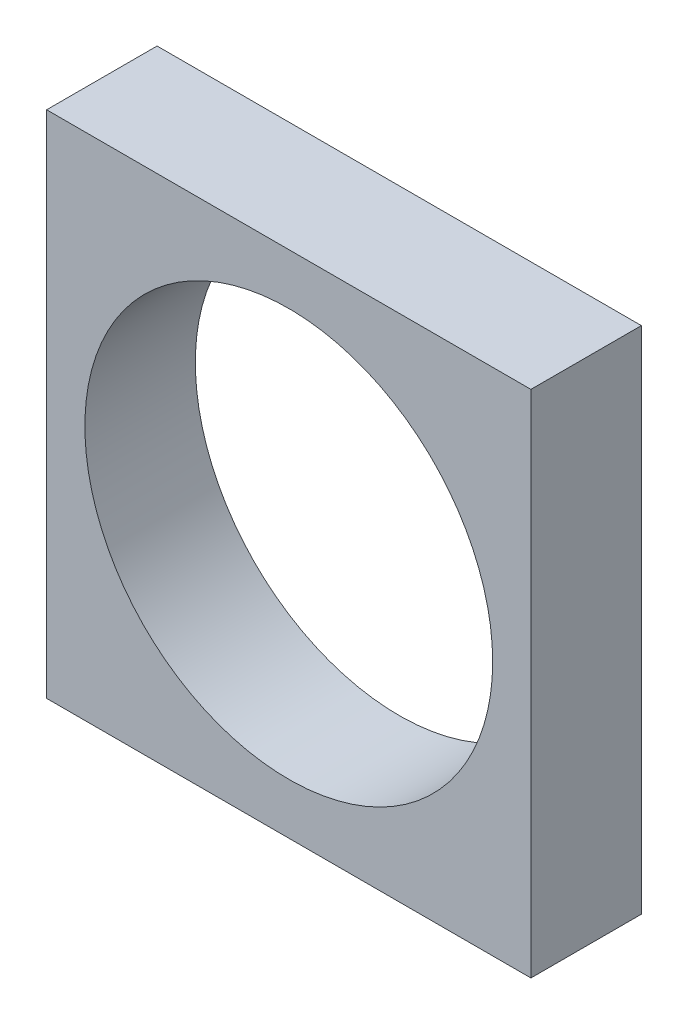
ISO-10303-21;
HEADER;
FILE_DESCRIPTION(('STEP AP214'),'2;1');
FILE_NAME('part.step','',(''),(''),'','','');
FILE_SCHEMA(('AUTOMOTIVE_DESIGN { 1 0 10303 214 1 1 1 1 }'));
ENDSEC;
DATA;
#1=APPLICATION_CONTEXT('core data for automotive mechanical design processes');
#2=APPLICATION_PROTOCOL_DEFINITION('international standard','automotive_design',2000,#1);
#3=PRODUCT_CONTEXT('',#1,'mechanical');
#4=PRODUCT('Part','Part','',(#3));
#5=PRODUCT_RELATED_PRODUCT_CATEGORY('part','',(#4));
#6=PRODUCT_DEFINITION_FORMATION('','',#4);
#7=PRODUCT_DEFINITION_CONTEXT('part definition',#1,'design');
#8=PRODUCT_DEFINITION('design','',#6,#7);
#9=PRODUCT_DEFINITION_SHAPE('','',#8);
#10=(LENGTH_UNIT() NAMED_UNIT(*) SI_UNIT(.MILLI.,.METRE.));
#11=(NAMED_UNIT(*) PLANE_ANGLE_UNIT() SI_UNIT($,.RADIAN.));
#12=(NAMED_UNIT(*) SI_UNIT($,.STERADIAN.) SOLID_ANGLE_UNIT());
#13=UNCERTAINTY_MEASURE_WITH_UNIT(LENGTH_MEASURE(1.E-05),#10,'distance_accuracy_value','');
#14=(GEOMETRIC_REPRESENTATION_CONTEXT(3) GLOBAL_UNCERTAINTY_ASSIGNED_CONTEXT((#13)) GLOBAL_UNIT_ASSIGNED_CONTEXT((#10,
#11,#12)) REPRESENTATION_CONTEXT('',''));
#15=CARTESIAN_POINT('',(0.,0.,0.));
#16=DIRECTION('',(0.,0.,1.));
#17=DIRECTION('',(1.,0.,0.));
#18=AXIS2_PLACEMENT_3D('',#15,#16,#17);
#19=CARTESIAN_POINT('',(0.,0.,13.));
#20=DIRECTION('',(1.,0.,0.));
#21=DIRECTION('',(0.,0.,-1.));
#22=AXIS2_PLACEMENT_3D('',#19,#20,#21);
#23=PLANE('',#22);
#24=DIRECTION('',(0.,-1.,0.));
#25=VECTOR('',#24,1.);
#26=CARTESIAN_POINT('',(0.,0.,0.));
#27=LINE('',#26,#25);
#28=CARTESIAN_POINT('',(0.,60.,0.));
#29=VERTEX_POINT('',#28);
#30=CARTESIAN_POINT('',(0.,0.,0.));
#31=VERTEX_POINT('',#30);
#32=EDGE_CURVE('E97',#29,#31,#27,.T.);
#33=ORIENTED_EDGE('',*,*,#32,.T.);
#34=DIRECTION('',(0.,0.,-1.));
#35=VECTOR('',#34,1.);
#36=CARTESIAN_POINT('',(0.,0.,13.));
#37=LINE('',#36,#35);
#38=CARTESIAN_POINT('',(0.,0.,13.));
#39=VERTEX_POINT('',#38);
#40=EDGE_CURVE('E11',#39,#31,#37,.T.);
#41=ORIENTED_EDGE('',*,*,#40,.F.);
#42=DIRECTION('',(0.,-1.,0.));
#43=VECTOR('',#42,1.);
#44=CARTESIAN_POINT('',(0.,0.,13.));
#45=LINE('',#44,#43);
#46=CARTESIAN_POINT('',(0.,60.,13.));
#47=VERTEX_POINT('',#46);
#48=EDGE_CURVE('E85',#47,#39,#45,.T.);
#49=ORIENTED_EDGE('',*,*,#48,.F.);
#50=DIRECTION('',(0.,0.,-1.));
#51=VECTOR('',#50,1.);
#52=CARTESIAN_POINT('',(0.,60.,13.));
#53=LINE('',#52,#51);
#54=EDGE_CURVE('E93',#47,#29,#53,.T.);
#55=ORIENTED_EDGE('',*,*,#54,.T.);
#56=EDGE_LOOP('',(#33,#41,#49,#55));
#57=FACE_BOUND('',#56,.T.);
#58=ADVANCED_FACE('F34',(#57),#23,.F.);
#59=CARTESIAN_POINT('',(0.,0.,13.));
#60=DIRECTION('',(0.,1.,0.));
#61=DIRECTION('',(0.,0.,1.));
#62=AXIS2_PLACEMENT_3D('',#59,#60,#61);
#63=PLANE('',#62);
#64=DIRECTION('',(1.,0.,0.));
#65=VECTOR('',#64,1.);
#66=CARTESIAN_POINT('',(0.,0.,0.));
#67=LINE('',#66,#65);
#68=CARTESIAN_POINT('',(57.,0.,0.));
#69=VERTEX_POINT('',#68);
#70=EDGE_CURVE('E89',#31,#69,#67,.T.);
#71=ORIENTED_EDGE('',*,*,#70,.T.);
#72=DIRECTION('',(0.,0.,-1.));
#73=VECTOR('',#72,1.);
#74=CARTESIAN_POINT('',(57.,0.,13.));
#75=LINE('',#74,#73);
#76=CARTESIAN_POINT('',(57.,0.,13.));
#77=VERTEX_POINT('',#76);
#78=EDGE_CURVE('E42',#77,#69,#75,.T.);
#79=ORIENTED_EDGE('',*,*,#78,.F.);
#80=DIRECTION('',(1.,0.,0.));
#81=VECTOR('',#80,1.);
#82=CARTESIAN_POINT('',(0.,0.,13.));
#83=LINE('',#82,#81);
#84=EDGE_CURVE('E80',#39,#77,#83,.T.);
#85=ORIENTED_EDGE('',*,*,#84,.F.);
#86=ORIENTED_EDGE('',*,*,#40,.T.);
#87=EDGE_LOOP('',(#71,#79,#85,#86));
#88=FACE_BOUND('',#87,.T.);
#89=ADVANCED_FACE('F88',(#88),#63,.F.);
#90=CARTESIAN_POINT('',(57.,0.,13.));
#91=DIRECTION('',(-1.,0.,0.));
#92=DIRECTION('',(0.,0.,1.));
#93=AXIS2_PLACEMENT_3D('',#90,#91,#92);
#94=PLANE('',#93);
#95=DIRECTION('',(0.,1.,0.));
#96=VECTOR('',#95,1.);
#97=CARTESIAN_POINT('',(57.,0.,0.));
#98=LINE('',#97,#96);
#99=CARTESIAN_POINT('',(57.,60.,0.));
#100=VERTEX_POINT('',#99);
#101=EDGE_CURVE('E67',#69,#100,#98,.T.);
#102=ORIENTED_EDGE('',*,*,#101,.T.);
#103=DIRECTION('',(0.,0.,-1.));
#104=VECTOR('',#103,1.);
#105=CARTESIAN_POINT('',(57.,60.,13.));
#106=LINE('',#105,#104);
#107=CARTESIAN_POINT('',(57.,60.,13.));
#108=VERTEX_POINT('',#107);
#109=EDGE_CURVE('E90',#108,#100,#106,.T.);
#110=ORIENTED_EDGE('',*,*,#109,.F.);
#111=DIRECTION('',(0.,1.,0.));
#112=VECTOR('',#111,1.);
#113=CARTESIAN_POINT('',(57.,0.,13.));
#114=LINE('',#113,#112);
#115=EDGE_CURVE('E83',#77,#108,#114,.T.);
#116=ORIENTED_EDGE('',*,*,#115,.F.);
#117=ORIENTED_EDGE('',*,*,#78,.T.);
#118=EDGE_LOOP('',(#102,#110,#116,#117));
#119=FACE_BOUND('',#118,.T.);
#120=ADVANCED_FACE('F91',(#119),#94,.F.);
#121=CARTESIAN_POINT('',(0.,60.,13.));
#122=DIRECTION('',(0.,-1.,0.));
#123=DIRECTION('',(0.,0.,-1.));
#124=AXIS2_PLACEMENT_3D('',#121,#122,#123);
#125=PLANE('',#124);
#126=DIRECTION('',(-1.,0.,0.));
#127=VECTOR('',#126,1.);
#128=CARTESIAN_POINT('',(0.,60.,0.));
#129=LINE('',#128,#127);
#130=EDGE_CURVE('E73',#100,#29,#129,.T.);
#131=ORIENTED_EDGE('',*,*,#130,.T.);
#132=ORIENTED_EDGE('',*,*,#54,.F.);
#133=DIRECTION('',(-1.,0.,0.));
#134=VECTOR('',#133,1.);
#135=CARTESIAN_POINT('',(0.,60.,13.));
#136=LINE('',#135,#134);
#137=EDGE_CURVE('E50',#108,#47,#136,.T.);
#138=ORIENTED_EDGE('',*,*,#137,.F.);
#139=ORIENTED_EDGE('',*,*,#109,.T.);
#140=EDGE_LOOP('',(#131,#132,#138,#139));
#141=FACE_BOUND('',#140,.T.);
#142=ADVANCED_FACE('F105',(#141),#125,.F.);
#143=CARTESIAN_POINT('',(0.,60.,13.));
#144=DIRECTION('',(0.,0.,-1.));
#145=DIRECTION('',(-1.,0.,0.));
#146=AXIS2_PLACEMENT_3D('',#143,#144,#145);
#147=PLANE('',#146);
#148=CARTESIAN_POINT('',(28.5,30.,13.));
#149=DIRECTION('',(0.,0.,1.));
#150=DIRECTION('',(1.,0.,0.));
#151=AXIS2_PLACEMENT_3D('',#148,#149,#150);
#152=CIRCLE('',#151,24.);
#153=CARTESIAN_POINT('',(52.5,30.,13.));
#154=VERTEX_POINT('',#153);
#155=EDGE_CURVE('E111',#154,#154,#152,.T.);
#156=ORIENTED_EDGE('',*,*,#155,.F.);
#157=EDGE_LOOP('',(#156));
#158=FACE_BOUND('',#157,.T.);
#159=ORIENTED_EDGE('',*,*,#48,.T.);
#160=ORIENTED_EDGE('',*,*,#84,.T.);
#161=ORIENTED_EDGE('',*,*,#115,.T.);
#162=ORIENTED_EDGE('',*,*,#137,.T.);
#163=EDGE_LOOP('',(#159,#160,#161,#162));
#164=FACE_BOUND('',#163,.T.);
#165=ADVANCED_FACE('F81',(#158,#164),#147,.F.);
#166=CARTESIAN_POINT('',(0.,60.,0.));
#167=DIRECTION('',(0.,0.,-1.));
#168=DIRECTION('',(-1.,0.,0.));
#169=AXIS2_PLACEMENT_3D('',#166,#167,#168);
#170=PLANE('',#169);
#171=CARTESIAN_POINT('',(28.5,30.,0.));
#172=DIRECTION('',(0.,0.,1.));
#173=DIRECTION('',(1.,0.,0.));
#174=AXIS2_PLACEMENT_3D('',#171,#172,#173);
#175=CIRCLE('',#174,24.);
#176=CARTESIAN_POINT('',(52.5,30.,0.));
#177=VERTEX_POINT('',#176);
#178=EDGE_CURVE('E100',#177,#177,#175,.T.);
#179=ORIENTED_EDGE('',*,*,#178,.T.);
#180=EDGE_LOOP('',(#179));
#181=FACE_BOUND('',#180,.T.);
#182=ORIENTED_EDGE('',*,*,#32,.F.);
#183=ORIENTED_EDGE('',*,*,#130,.F.);
#184=ORIENTED_EDGE('',*,*,#101,.F.);
#185=ORIENTED_EDGE('',*,*,#70,.F.);
#186=EDGE_LOOP('',(#182,#183,#184,#185));
#187=FACE_BOUND('',#186,.T.);
#188=ADVANCED_FACE('F108',(#181,#187),#170,.T.);
#189=CARTESIAN_POINT('',(28.5,30.,0.));
#190=DIRECTION('',(0.,0.,1.));
#191=DIRECTION('',(1.,0.,0.));
#192=AXIS2_PLACEMENT_3D('',#189,#190,#191);
#193=CYLINDRICAL_SURFACE('',#192,24.);
#194=CARTESIAN_POINT('',(52.5,30.,0.));
#195=CARTESIAN_POINT('',(52.5,30.,0.135416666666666));
#196=CARTESIAN_POINT('',(52.5,30.,0.270833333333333));
#197=CARTESIAN_POINT('',(52.5,30.,0.541666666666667));
#198=CARTESIAN_POINT('',(52.5,30.,0.677083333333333));
#199=CARTESIAN_POINT('',(52.5,30.,0.947916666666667));
#200=CARTESIAN_POINT('',(52.5,30.,1.08333333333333));
#201=CARTESIAN_POINT('',(52.5,30.,1.35416666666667));
#202=CARTESIAN_POINT('',(52.5,30.,1.48958333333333));
#203=CARTESIAN_POINT('',(52.5,30.,1.76041666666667));
#204=CARTESIAN_POINT('',(52.5,30.,1.89583333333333));
#205=CARTESIAN_POINT('',(52.5,30.,2.16666666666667));
#206=CARTESIAN_POINT('',(52.5,30.,2.30208333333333));
#207=CARTESIAN_POINT('',(52.5,30.,2.57291666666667));
#208=CARTESIAN_POINT('',(52.5,30.,2.70833333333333));
#209=CARTESIAN_POINT('',(52.5,30.,2.97916666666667));
#210=CARTESIAN_POINT('',(52.5,30.,3.11458333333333));
#211=CARTESIAN_POINT('',(52.5,30.,3.38541666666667));
#212=CARTESIAN_POINT('',(52.5,30.,3.52083333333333));
#213=CARTESIAN_POINT('',(52.5,30.,3.79166666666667));
#214=CARTESIAN_POINT('',(52.5,30.,3.92708333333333));
#215=CARTESIAN_POINT('',(52.5,30.,4.19791666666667));
#216=CARTESIAN_POINT('',(52.5,30.,4.33333333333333));
#217=CARTESIAN_POINT('',(52.5,30.,4.60416666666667));
#218=CARTESIAN_POINT('',(52.5,30.,4.73958333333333));
#219=CARTESIAN_POINT('',(52.5,30.,5.01041666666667));
#220=CARTESIAN_POINT('',(52.5,30.,5.14583333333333));
#221=CARTESIAN_POINT('',(52.5,30.,5.41666666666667));
#222=CARTESIAN_POINT('',(52.5,30.,5.55208333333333));
#223=CARTESIAN_POINT('',(52.5,30.,5.82291666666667));
#224=CARTESIAN_POINT('',(52.5,30.,5.95833333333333));
#225=CARTESIAN_POINT('',(52.5,30.,6.22916666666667));
#226=CARTESIAN_POINT('',(52.5,30.,6.36458333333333));
#227=CARTESIAN_POINT('',(52.5,30.,6.63541666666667));
#228=CARTESIAN_POINT('',(52.5,30.,6.77083333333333));
#229=CARTESIAN_POINT('',(52.5,30.,7.04166666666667));
#230=CARTESIAN_POINT('',(52.5,30.,7.17708333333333));
#231=CARTESIAN_POINT('',(52.5,30.,7.44791666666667));
#232=CARTESIAN_POINT('',(52.5,30.,7.58333333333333));
#233=CARTESIAN_POINT('',(52.5,30.,7.85416666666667));
#234=CARTESIAN_POINT('',(52.5,30.,7.98958333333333));
#235=CARTESIAN_POINT('',(52.5,30.,8.26041666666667));
#236=CARTESIAN_POINT('',(52.5,30.,8.39583333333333));
#237=CARTESIAN_POINT('',(52.5,30.,8.66666666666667));
#238=CARTESIAN_POINT('',(52.5,30.,8.80208333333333));
#239=CARTESIAN_POINT('',(52.5,30.,9.07291666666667));
#240=CARTESIAN_POINT('',(52.5,30.,9.20833333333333));
#241=CARTESIAN_POINT('',(52.5,30.,9.47916666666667));
#242=CARTESIAN_POINT('',(52.5,30.,9.61458333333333));
#243=CARTESIAN_POINT('',(52.5,30.,9.88541666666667));
#244=CARTESIAN_POINT('',(52.5,30.,10.0208333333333));
#245=CARTESIAN_POINT('',(52.5,30.,10.2916666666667));
#246=CARTESIAN_POINT('',(52.5,30.,10.4270833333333));
#247=CARTESIAN_POINT('',(52.5,30.,10.6979166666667));
#248=CARTESIAN_POINT('',(52.5,30.,10.8333333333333));
#249=CARTESIAN_POINT('',(52.5,30.,11.1041666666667));
#250=CARTESIAN_POINT('',(52.5,30.,11.2395833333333));
#251=CARTESIAN_POINT('',(52.5,30.,11.5104166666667));
#252=CARTESIAN_POINT('',(52.5,30.,11.6458333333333));
#253=CARTESIAN_POINT('',(52.5,30.,11.9166666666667));
#254=CARTESIAN_POINT('',(52.5,30.,12.0520833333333));
#255=CARTESIAN_POINT('',(52.5,30.,12.3229166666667));
#256=CARTESIAN_POINT('',(52.5,30.,12.4583333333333));
#257=CARTESIAN_POINT('',(52.5,30.,12.7291666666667));
#258=CARTESIAN_POINT('',(52.5,30.,12.8645833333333));
#259=CARTESIAN_POINT('',(52.5,30.,13.));
#260=B_SPLINE_CURVE_WITH_KNOTS('',3,(#194,#195,#196,#197,#198,#199,#200,#201,#202,#203,#204,
#205,#206,#207,#208,#209,#210,#211,#212,#213,#214,#215,#216,#217,#218,#219,#220,#221,#222,#223,
#224,#225,#226,#227,#228,#229,#230,#231,#232,#233,#234,#235,#236,#237,#238,#239,#240,#241,#242,
#243,#244,#245,#246,#247,#248,#249,#250,#251,#252,#253,#254,#255,#256,#257,#258,#259),
.UNSPECIFIED.,.F.,.F.,(4,2,2,2,2,2,2,2,2,2,2,2,2,2,2,2,2,2,2,2,2,2,2,2,2,2,2,2,2,2,2,2,4),(0.,
0.40625,0.8125,1.21875,1.625,2.03125,2.4375,2.84375,3.25,3.65625,4.0625,4.46875,4.875,5.28125,
5.6875,6.09375,6.5,6.90625,7.3125,7.71875,8.125,8.53125,8.9375,9.34375,9.75,10.15625,10.5625,
10.96875,11.375,11.78125,12.1875,12.59375,13.),.UNSPECIFIED.);
#261=EDGE_CURVE('BSEAM118',#177,#154,#260,.T.);
#262=ORIENTED_EDGE('',*,*,#178,.F.);
#263=ORIENTED_EDGE('',*,*,#155,.T.);
#264=ORIENTED_EDGE('',*,*,#261,.T.);
#265=ORIENTED_EDGE('',*,*,#261,.F.);
#266=EDGE_LOOP('',(#262,#264,#263,#265));
#267=FACE_BOUND('',#266,.T.);
#268=ADVANCED_FACE('F118',(#267),#193,.F.);
#269=CLOSED_SHELL('',(#58,#89,#120,#142,#165,#188,#268));
#270=MANIFOLD_SOLID_BREP('B2',#269);
#271=ADVANCED_BREP_SHAPE_REPRESENTATION('',(#18,#270),#14);
#272=SHAPE_DEFINITION_REPRESENTATION(#9,#271);
ENDSEC;
END-ISO-10303-21;
